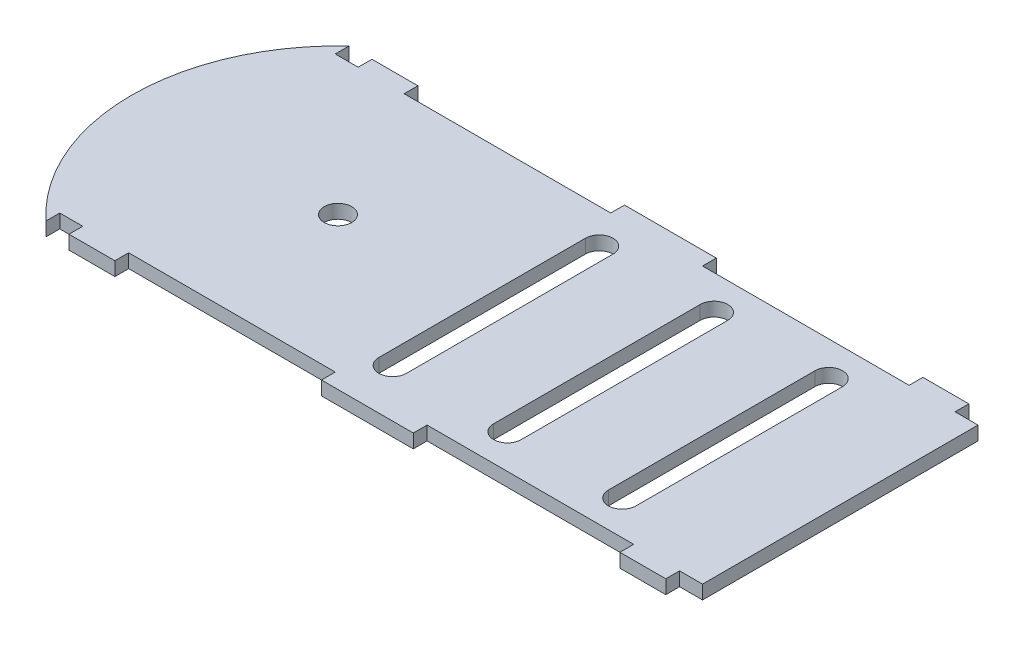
from build123d import *

# Parameters (mm, degrees)
BOSS_EXTRUDE1_DEPTH = 3
SKETCH2_W           = 10
SKETCH2_H           = 3
SKETCH2_W_2         = 20
BOSS_EXTRUDE2_DEPTH = 3
CUT_EXTRUDE1_DEPTH  = 10
SKETCH5_R           = 3
CUT_EXTRUDE2_DEPTH  = 10


with BuildPart() as part:
    # Sketch1 → Boss-Extrude1 (new body)
    with BuildSketch(Plane(origin=(0, 0, 0), x_dir=(1, 0, 0), z_dir=(0, 1, 0))):
        with BuildLine():
            Line((-70, 30), (70, 30))
            Line((70, 30), (70, -30))
            Line((70, -30), (-70, -30))
            Line((-70, -30), (-70, -33))
            ThreePointArc((-70, -33), (-84.405882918, 0), (-70, 33))
            Line((-70, 33), (-70, 30))
        make_face()
    extrude(amount=BOSS_EXTRUDE1_DEPTH)

    # Sketch2 → Boss-Extrude2 (add)
    with BuildSketch(Plane(origin=(0, 0, 0), x_dir=(1, 0, 0), z_dir=(0, 1, 0))):
        with Locations((-60, 31.5)):
            Rectangle(SKETCH2_W, SKETCH2_H)
        with Locations((60, 31.5)):
            Rectangle(SKETCH2_W, SKETCH2_H)
        with Locations((60, -31.5)):
            Rectangle(SKETCH2_W, SKETCH2_H)
        with Locations((-60, -31.5)):
            Rectangle(SKETCH2_W, SKETCH2_H)
        with Locations((0, 31.5)):
            Rectangle(SKETCH2_W_2, SKETCH2_H)
        with Locations((0, -31.5)):
            Rectangle(SKETCH2_W_2, SKETCH2_H)
    extrude(amount=BOSS_EXTRUDE2_DEPTH)

    # Sketch3 → Cut-Extrude1 (cut)
    with BuildSketch(Plane(origin=(0, 0, 0), x_dir=(1, 0, 0), z_dir=(0, 1, 0))):
        with BuildLine():
            Line((17, -22.5), (17, 22.5))
            ThreePointArc((17, 22.5), (20, 25.5), (23, 22.5))
            Line((23, 22.5), (23, -22.5))
            ThreePointArc((23, -22.5), (20, -25.5), (17, -22.5))
        make_face()
        with BuildLine():
            Line((42, -22.5), (42, 22.5))
            ThreePointArc((42, 22.5), (45, 25.5), (48, 22.5))
            Line((48, 22.5), (48, -22.5))
            ThreePointArc((48, -22.5), (45, -25.5), (42, -22.5))
        make_face()
        with BuildLine():
            Line((-8, -22.5), (-8, 22.5))
            ThreePointArc((-8, 22.5), (-5, 25.5), (-2, 22.5))
            Line((-2, 22.5), (-2, -22.5))
            ThreePointArc((-2, -22.5), (-5, -25.5), (-8, -22.5))
        make_face()
    extrude(amount=CUT_EXTRUDE1_DEPTH, mode=Mode.SUBTRACT)

    # Sketch5 → Cut-Extrude2 (cut)
    with BuildSketch(Plane(origin=(0, 0, 0), x_dir=(1, 0, 0), z_dir=(0, 1, 0))):
        with Locations(Location((-39.405882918, 0, 0), (0, 0, 270))):
            Circle(SKETCH5_R)
    extrude(amount=CUT_EXTRUDE2_DEPTH, mode=Mode.SUBTRACT)


solid = part.part
